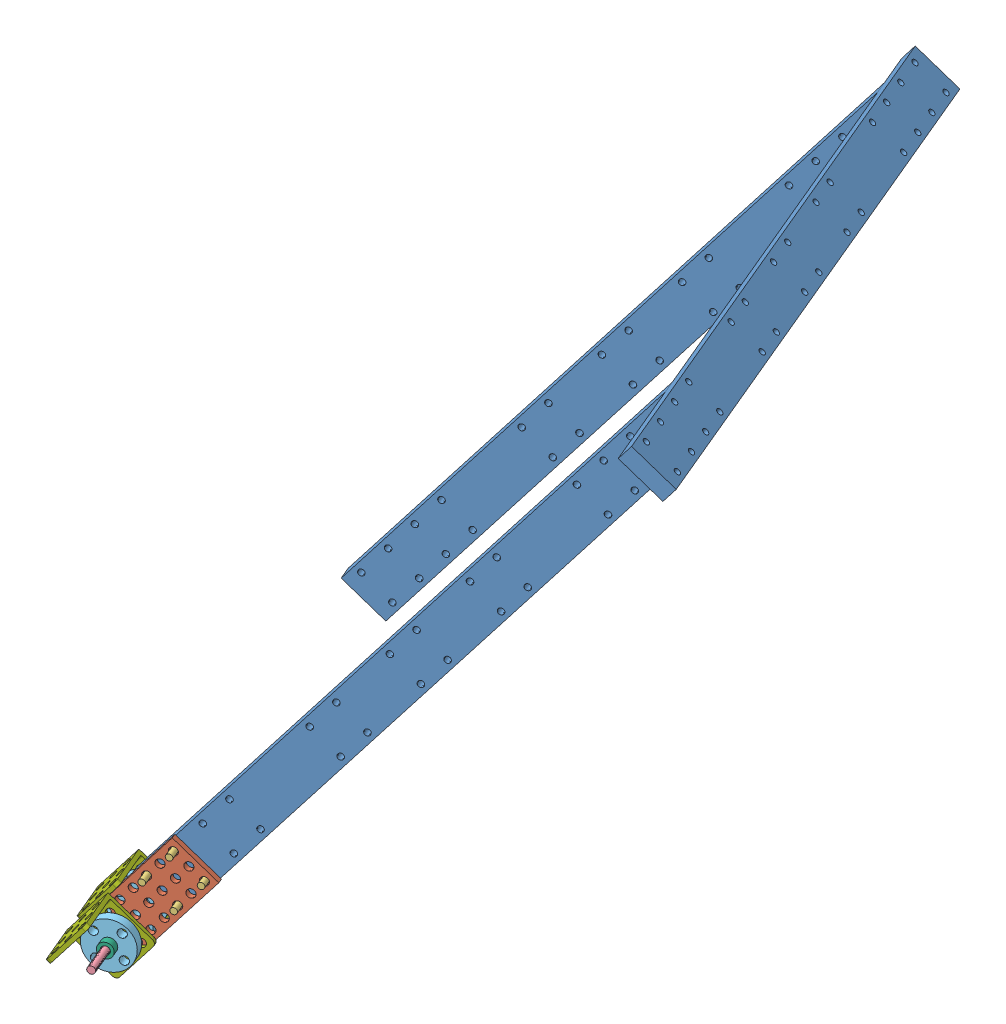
SolidWorks assembly 手2.SLDASM, configuration 默认 (file format 10000). Lengths in mm.
Overall size (321.45 300.06 402.63).
26 component instances, 7 part files, 34 mates.
Components (placement in the parent):
- 手基本零件-2: 手基本零件.SLDPRT [默认] at (126.9155 -186.1616 34.9689) x (0.528541 0.776284 -0.34355) z (0.729588 -0.622284 -0.283662) size (321 8 23)
- 手基本零件-4: 手基本零件.SLDPRT [默认] at (231.0726 -161.9882 249.8339) x (0.528541 0.776284 -0.34355) z (0.729588 -0.622284 -0.283662) size (321 8 23)
- 手基本零件-6: 手基本零件.SLDPRT [默认] at (287.9274 44.2904 -66.0553) x (0.433988 0.100723 0.895271) z (-0.729588 0.622284 0.283662) size (321 8 23)
- 6x3-1: 6x3.SLDPRT [默认] at (223.8915 -177.3277 263.9766) x (0.528541 0.776284 -0.34355) z (0.729588 -0.622284 -0.283662) size (48 3 24)
- 钉子-1: 钉子.SLDPRT [默认] at (236.9617 -167.6798 241.7778) x (0.828889 -0.433988 -0.352983) z (-0.352983 -0.895271 0.271833) size (3 20 3)
- 钉子-2: 钉子.SLDPRT [默认] at (225.757 -157.6145 247.2833) x (0.828889 -0.433988 -0.352983) z (-0.352983 -0.895271 0.271833) size (3 20 3)
- 钉子-3: 钉子.SLDPRT [默认] at (228.8302 -180.0249 247.9454) x (0.828889 -0.433988 -0.352983) z (-0.352983 -0.895271 0.271833) size (3 20 3)
- 钉子-4: 钉子.SLDPRT [默认] at (225.6893 -168.0603 271.5721) x (-0.609621 -0.698842 0.374141) z (0.663337 -0.708149 -0.241886) size (3 20 3)
- 柱子-1: 柱子.SLDPRT [默认] at (199.0851 -196.9626 235.8788) x (0.828889 -0.433988 -0.352983) z (-0.352983 -0.895271 0.271833) size (3.5 75 3.5)
- 法-1: 法.SLDASM [默认] at (229.3162 -207.4031 261.7415) x (0.529179 0.77574 -0.343797) z (-0.729126 0.622962 0.283362) size (22.24 9 22.24)
  - 法兰轴2-1: 法兰轴2.SLDPRT [默认] at (27.956 -2.676 36.0053) size (22.24 5 22.24)
  - 法老你-1: 法老你.SLDPRT [默认] at (11.6244 2.324 33.7573) size (7 4 7)
- 法老你-1: 法老你.SLDPRT [默认] at (213.1373 -207.5727 262.5396) x (-0.609621 -0.698842 0.374141) z (0.663337 -0.708149 -0.241886) size (7 4 7)
- 法-2: 法.SLDASM [默认] at (217.237 -175.2183 245.3805) x (0.729588 -0.622284 -0.283662) z (-0.528541 -0.776284 0.34355) size (22.24 9 22.24)
  - 法兰轴2-1: 法兰轴2.SLDPRT [默认] at (27.956 -2.676 36.0053) size (22.24 5 22.24)
  - 法老你-1: 法老你.SLDPRT [默认] at (11.6244 2.324 33.7573) size (7 4 7)
- 搞了半天的90度折角件-1: 搞了半天的90度折角件.SLDPRT [默认] at (212.2932 -173.5287 271.4055) x (-0.433988 -0.100723 -0.895271) z (-0.528541 -0.776284 0.34355) size (26 26 24)
- 法-3: 法.SLDASM [默认] at (188.2681 -179.4346 251.6252) x (-0.528541 -0.776284 0.34355) z (0.729588 -0.622284 -0.283662) size (22.24 9 22.24)
  - 法兰轴2-1: 法兰轴2.SLDPRT [默认] at (27.956 -2.676 36.0053) size (22.24 5 22.24)
  - 法老你-1: 法老你.SLDPRT [默认] at (11.6244 2.324 33.7573) size (7 4 7)
- 法老你-2: 法老你.SLDPRT [默认] at (220.5456 -205.9589 272.1706) x (0.828889 -0.433988 -0.352983) z (-0.352983 -0.895271 0.271833) size (7 4 7)
- 法老你-3: 法老你.SLDPRT [默认] at (222.2815 -205.556 275.7517) x (0.828889 -0.433988 -0.352983) z (-0.352983 -0.895271 0.271833) size (7 4 7)
- 搞了半天的90度折角件-2: 搞了半天的90度折角件.SLDPRT [默认] at (227.4827 -170.0034 302.7399) x (-0.433988 -0.100723 -0.895271) z (-0.528541 -0.776284 0.34355) size (26 26 24)
- 法-4: 法.SLDASM [默认] at (232.4266 -171.693 276.715) x (0.729588 -0.622284 -0.283662) z (-0.528541 -0.776284 0.34355) size (22.24 9 22.24)
  - 法兰轴2-1: 法兰轴2.SLDPRT [默认] at (27.956 -2.676 36.0053) size (22.24 5 22.24)
  - 法老你-1: 法老你.SLDPRT [默认] at (11.6244 2.324 33.7573) size (7 4 7)
Mates (geometry in assembly coordinates):
- 重合7: coincident anti-aligned: line of 手基本零件-2 through (280.868 52.8332 -57.6128) axis (-0.433988 -0.100723 -0.895271); line of 手基本零件-6 through (268.8681 50.0481 -82.3675) axis (0.433988 0.100723 0.895271)
- 平行5: parallel aligned: line of 手基本零件-2 through (294.1767 37.7148 -71.2992) axis (-0.729588 0.622284 0.283662); line of 手基本零件-6 through (285.6486 35.7356 -88.8917) axis (-0.729588 0.622284 0.283662)
- 平行6: parallel anti-aligned: plane of 手基本零件-2 through (130.3874 -185.3558 42.1311) normal (0.433988 0.100723 0.895271); plane of 6x3-1 through (223.8915 -177.3277 263.9766) normal (-0.433988 -0.100723 -0.895271)
- 平行7: parallel anti-aligned: line of 手基本零件-2 through (111.2063 -196.3542 52.6666) axis (0.729588 -0.622284 -0.283662); line of 6x3-1 through (247.3078 -165.0684 251.2461) axis (-0.729588 0.622284 0.283662)
- 平行8: parallel anti-aligned: plane of 手基本零件-4 through (231.0726 -161.9882 249.8339) normal (-0.433988 -0.100723 -0.895271); plane of 6x3-1 through (225.1935 -177.0255 266.6624) normal (0.433988 0.100723 0.895271)
- 平行9: parallel anti-aligned: plane of 6x3-1 through (223.8915 -177.3277 263.9766) normal (-0.433988 -0.100723 -0.895271); plane of 钉子-1 through (245.2134 -165.0025 259.8161) normal (0.433988 0.100723 0.895271)
- 平行10: parallel aligned: plane of 6x3-1 through (223.8915 -177.3277 263.9766) normal (-0.433988 -0.100723 -0.895271); plane of 钉子-2 through (225.329 -156.9516 247.4163) normal (-0.433988 -0.100723 -0.895271)
- 平行11: parallel aligned: plane of 6x3-1 through (223.8915 -177.3277 263.9766) normal (-0.433988 -0.100723 -0.895271); plane of 钉子-3 through (228.4022 -179.3621 248.0783) normal (-0.433988 -0.100723 -0.895271)
- 平行12: parallel aligned: plane of 6x3-1 through (223.8915 -177.3277 263.9766) normal (-0.433988 -0.100723 -0.895271); plane of 柱子-1 through (202.0039 -200.3173 234.8413) normal (-0.433988 -0.100723 -0.895271)
- 同心7: concentric anti-aligned: circle of 6x3-1; circle of 法-1/法兰轴2-1
- 重合27: coincident anti-aligned: plane of 6x3-1 through (223.8915 -177.3277 263.9766) normal (-0.433988 -0.100723 -0.895271); plane of 法-1/法兰轴2-1 through (215.2969 -191.7575 269.7663) normal (0.433988 0.100723 0.895271)
- 重合28: coincident anti-aligned: plane of 法-1/法老你-1 through (211.391 -192.664 261.7088) normal (-0.433988 -0.100723 -0.895271); plane of 法老你-1 through (211.391 -192.664 261.7088) normal (0.433988 0.100723 0.895271)
- 同心8: concentric aligned: circle of 法-1/法老你-1; circle of 法老你-1
- 重合30: coincident anti-aligned: plane of 法老你-1 through (209.6551 -193.0669 258.1277) normal (-0.433988 -0.100723 -0.895271); plane of 法-2/法老你-1 through (209.6551 -193.0669 258.1277) normal (0.433988 0.100723 0.895271)
- 重合31: coincident anti-aligned: circle of 法老你-1; circle of 法-2/法老你-1
- 同心13: concentric aligned: circle of 6x3-1; circle of 法-2/法兰轴2-1
- 重合37: coincident aligned: circle of 6x3-1; circle of 法老你-2
- 重合38: coincident aligned: circle of 法老你-2; circle of 法老你-3
- 重合56: coincident anti-aligned: plane of 手基本零件-4 through (234.5445 -161.1824 256.996) normal (0.433988 0.100723 0.895271); plane of 6x3-1 through (223.8915 -177.3277 263.9766) normal (-0.433988 -0.100723 -0.895271)
- 同心21: concentric aligned: circle of 手基本零件-4; circle of 钉子-1
- 同心22: concentric aligned: circle of 手基本零件-4; circle of 钉子-2
- 同心23: concentric aligned: circle of 手基本零件-4; circle of 钉子-3
- 同心24: concentric anti-aligned: circle of 手基本零件-4; circle of 钉子-4
- 同心27: concentric anti-aligned: circle of 柱子-1; circle of 法-3/法老你-1
- 同心28: concentric aligned: circle of 手基本零件-4; circle of 6x3-1
- 同心29: concentric aligned: circle of 法老你-2; circle of 搞了半天的90度折角件-2
- 重合58: coincident anti-aligned: plane of 法老你-3 through (220.0708 -190.6496 279.6142) normal (0.433988 0.100723 0.895271); plane of 搞了半天的90度折角件-2 through (217.6582 -173.8668 278.8956) normal (-0.433988 -0.100723 -0.895271)
- 同心34: concentric aligned: circle of 法-2/法兰轴2-1; circle of 搞了半天的90度折角件-1
- 同心37: concentric aligned: circle of 法-2/法兰轴2-1; circle of 搞了半天的90度折角件-1
- 重合63: coincident anti-aligned: plane of 法-2/法兰轴2-1 through (205.7492 -193.9734 250.0703) normal (-0.433988 -0.100723 -0.895271); plane of 搞了半天的90度折角件-1 through (220.8467 -192.1254 242.5438) normal (0.433988 0.100723 0.895271)
- 同心38: concentric aligned: circle of 法-2/法兰轴2-1; circle of 搞了半天的90度折角件-2
- 同心39: concentric aligned: circle of 搞了半天的90度折角件-2; circle of 法-4/法老你-1
- 重合67: coincident anti-aligned: plane of 搞了半天的90度折角件-2 through (236.0363 -188.6001 273.8782) normal (0.433988 0.100723 0.895271); plane of 法-4/法兰轴2-1 through (220.9388 -190.4481 281.4048) normal (-0.433988 -0.100723 -0.895271)
- 同心40: concentric anti-aligned: circle of 搞了半天的90度折角件-1; circle of 法-3/法兰轴2-1
